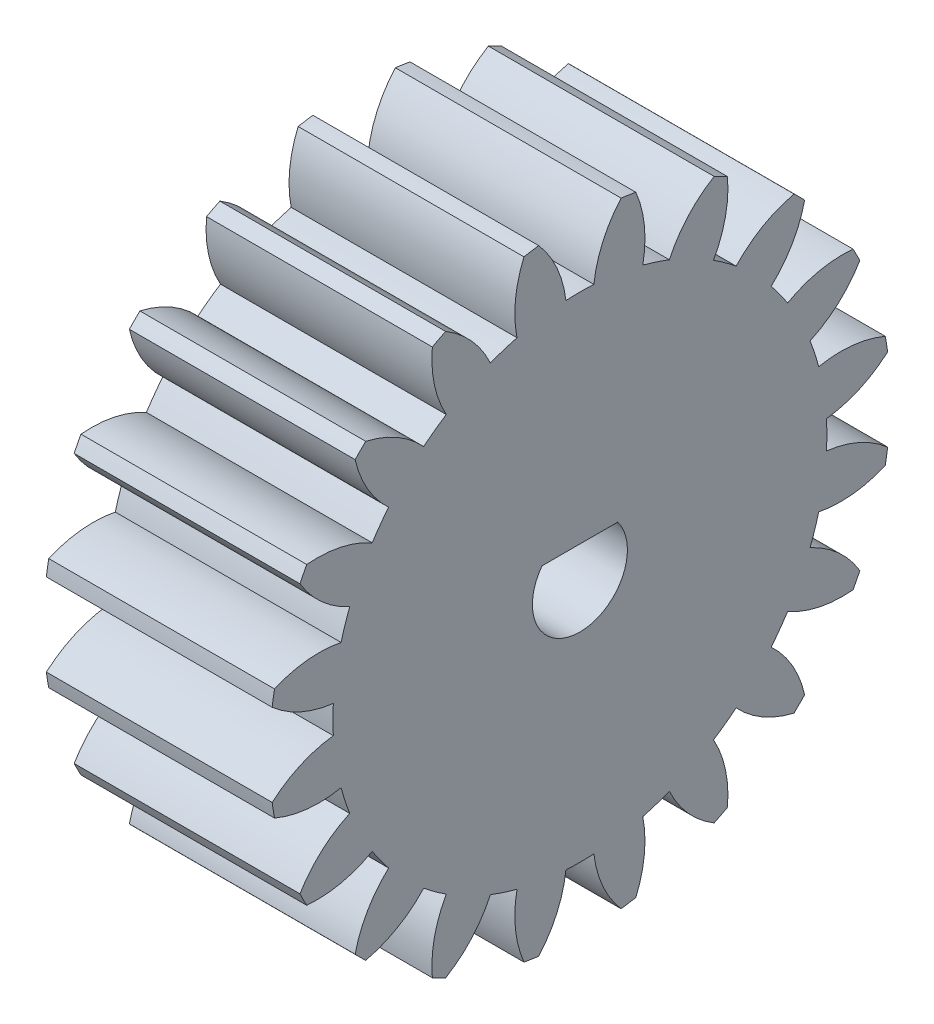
from build123d import *

# Parameters (mm, degrees)
BASPROSKE_W        = 20
BASPROSKE_H        = 27.5
TOOTHCUT_DEPTH     = 44.732139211
TEETHCUTS_COUNT    = 20
TEETHCUTS_ANGLE    = 342
SCALE1_SCALE       = 0.6
CUT_EXTRUDE1_DEPTH = 29.123355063


with BuildPart() as part:
    # BasProSke → Base-Revolve (revolve)
    with BuildSketch(Plane(origin=(0, 0, 0), x_dir=(1, 0, 0), z_dir=(0, 1, 0)), mode=Mode.PRIVATE) as base_revolve_sk:
        with Locations((10, 13.75)):
            Rectangle(BASPROSKE_W, BASPROSKE_H)
    revolve(base_revolve_sk.sketch.rotate(Axis((-10, 0, 0), (1, 0, 0)), 180), axis=Axis((-10, 0, 0), (1, 0, 0)))

    # TooCutSke → ToothCut (cut, through all)
    with BuildSketch(Plane(origin=(0, 0, 0), x_dir=(0, 0, -1), z_dir=(1, 0, 0))):
        with BuildLine():
            ThreePointArc((1.237725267, 21.838954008), (0, 21.874), (-1.237725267, 21.838954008))
            ThreePointArc((-1.237725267, 21.838954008), (-2.037783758, 24.744650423), (-3.667234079, 27.280011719))
            ThreePointArc((-3.667234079, 27.280011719), (0, 27.5254), (3.667234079, 27.280011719))
            ThreePointArc((3.667234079, 27.280011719), (2.037783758, 24.744650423), (1.237725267, 21.838954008))
        make_face()
    toothcut = extrude(amount=TOOTHCUT_DEPTH, mode=Mode.SUBTRACT)

    # TeethCuts: ToothCut ×20 about axis
    teethcuts_axis = Axis((-10, 0, 0), (1, 0, 0))
    for i in range(1, TEETHCUTS_COUNT):
        add(toothcut.rotate(teethcuts_axis, i * TEETHCUTS_ANGLE / (TEETHCUTS_COUNT - 1)), mode=Mode.SUBTRACT)


with BuildPart() as part_1:
    # Scale1: scaled about (10, 0, 0)
    add(part.part.scale(SCALE1_SCALE).moved(Location((4, 0, 0))))

    # Sketch1 → Cut-Extrude1 (cut, through all)
    with BuildSketch(Plane(origin=(0, 0, 0), x_dir=(0, 0, -1), z_dir=(1, 0, 0))):
        with BuildLine():
            Line((-2.01, 1.528242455), (2.01, 1.528242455))
            ThreePointArc((2.01, 1.528242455), (0, -2.525), (-2.01, 1.528242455))
        make_face()
    extrude(amount=CUT_EXTRUDE1_DEPTH, mode=Mode.SUBTRACT)


solid = part_1.part
